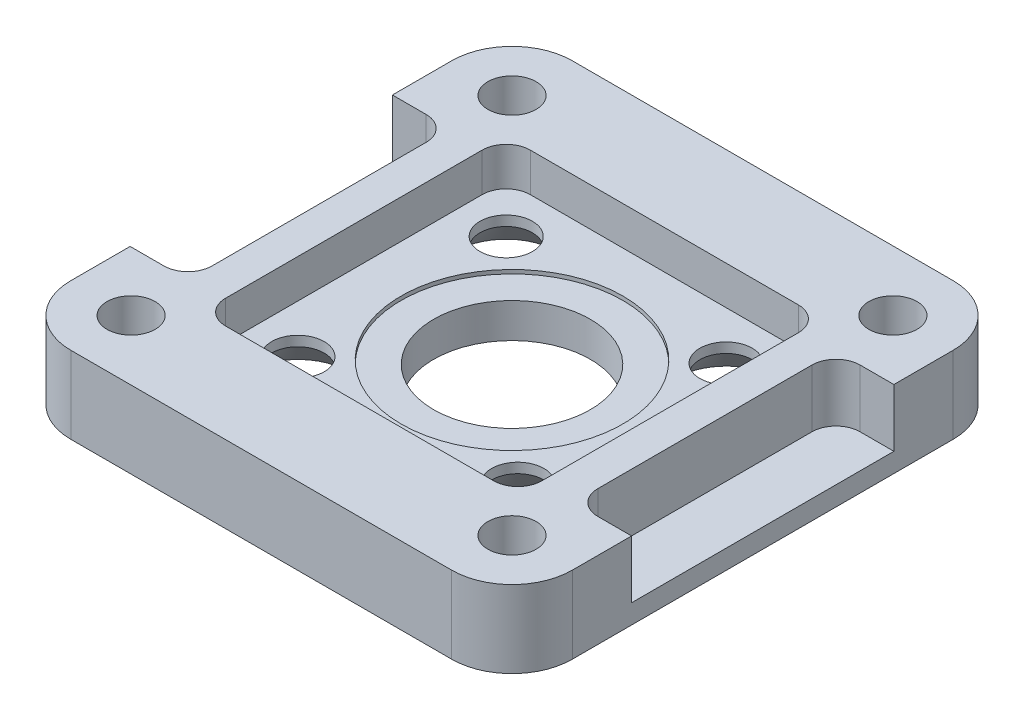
ISO-10303-21;
HEADER;
FILE_DESCRIPTION(('STEP AP214'),'2;1');
FILE_NAME('part.step','',(''),(''),'','','');
FILE_SCHEMA(('AUTOMOTIVE_DESIGN { 1 0 10303 214 1 1 1 1 }'));
ENDSEC;
DATA;
#1=APPLICATION_CONTEXT('core data for automotive mechanical design processes');
#2=APPLICATION_PROTOCOL_DEFINITION('international standard','automotive_design',2000,#1);
#3=PRODUCT_CONTEXT('',#1,'mechanical');
#4=PRODUCT('Part','Part','',(#3));
#5=PRODUCT_RELATED_PRODUCT_CATEGORY('part','',(#4));
#6=PRODUCT_DEFINITION_FORMATION('','',#4);
#7=PRODUCT_DEFINITION_CONTEXT('part definition',#1,'design');
#8=PRODUCT_DEFINITION('design','',#6,#7);
#9=PRODUCT_DEFINITION_SHAPE('','',#8);
#10=(LENGTH_UNIT() NAMED_UNIT(*) SI_UNIT(.MILLI.,.METRE.));
#11=(NAMED_UNIT(*) PLANE_ANGLE_UNIT() SI_UNIT($,.RADIAN.));
#12=(NAMED_UNIT(*) SI_UNIT($,.STERADIAN.) SOLID_ANGLE_UNIT());
#13=UNCERTAINTY_MEASURE_WITH_UNIT(LENGTH_MEASURE(1.E-05),#10,'distance_accuracy_value','');
#14=(GEOMETRIC_REPRESENTATION_CONTEXT(3) GLOBAL_UNCERTAINTY_ASSIGNED_CONTEXT((#13)) GLOBAL_UNIT_ASSIGNED_CONTEXT((#10,
#11,#12)) REPRESENTATION_CONTEXT('',''));
#15=CARTESIAN_POINT('',(0.,0.,0.));
#16=DIRECTION('',(0.,0.,1.));
#17=DIRECTION('',(1.,0.,0.));
#18=AXIS2_PLACEMENT_3D('',#15,#16,#17);
#19=CARTESIAN_POINT('',(0.,0.,0.));
#20=DIRECTION('',(0.,1.,0.));
#21=DIRECTION('',(0.,0.,1.));
#22=AXIS2_PLACEMENT_3D('',#19,#20,#21);
#23=PLANE('',#22);
#24=CARTESIAN_POINT('',(0.,0.,0.));
#25=DIRECTION('',(0.,1.,0.));
#26=DIRECTION('',(0.,0.,1.));
#27=AXIS2_PLACEMENT_3D('',#24,#25,#26);
#28=CIRCLE('',#27,5.15937500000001);
#29=CARTESIAN_POINT('',(0.,0.,5.15937500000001));
#30=VERTEX_POINT('',#29);
#31=EDGE_CURVE('E283',#30,#30,#28,.T.);
#32=ORIENTED_EDGE('',*,*,#31,.T.);
#33=EDGE_LOOP('',(#32));
#34=FACE_BOUND('',#33,.T.);
#35=CARTESIAN_POINT('',(-12.54125,0.,-12.54125));
#36=DIRECTION('',(0.,1.,0.));
#37=DIRECTION('',(0.,0.,1.));
#38=AXIS2_PLACEMENT_3D('',#35,#36,#37);
#39=CIRCLE('',#38,1.5875);
#40=CARTESIAN_POINT('',(-12.54125,0.,-10.95375));
#41=VERTEX_POINT('',#40);
#42=EDGE_CURVE('E308',#41,#41,#39,.T.);
#43=ORIENTED_EDGE('',*,*,#42,.T.);
#44=EDGE_LOOP('',(#43));
#45=FACE_BOUND('',#44,.T.);
#46=CARTESIAN_POINT('',(12.54125,0.,-12.54125));
#47=DIRECTION('',(0.,1.,0.));
#48=DIRECTION('',(0.,0.,1.));
#49=AXIS2_PLACEMENT_3D('',#46,#47,#48);
#50=CIRCLE('',#49,1.5875);
#51=CARTESIAN_POINT('',(12.54125,0.,-10.95375));
#52=VERTEX_POINT('',#51);
#53=EDGE_CURVE('E314',#52,#52,#50,.T.);
#54=ORIENTED_EDGE('',*,*,#53,.T.);
#55=EDGE_LOOP('',(#54));
#56=FACE_BOUND('',#55,.T.);
#57=CARTESIAN_POINT('',(12.54125,0.,12.54125));
#58=DIRECTION('',(0.,1.,0.));
#59=DIRECTION('',(0.,0.,1.));
#60=AXIS2_PLACEMENT_3D('',#57,#58,#59);
#61=CIRCLE('',#60,1.5875);
#62=CARTESIAN_POINT('',(12.54125,0.,14.12875));
#63=VERTEX_POINT('',#62);
#64=EDGE_CURVE('E320',#63,#63,#61,.T.);
#65=ORIENTED_EDGE('',*,*,#64,.T.);
#66=EDGE_LOOP('',(#65));
#67=FACE_BOUND('',#66,.T.);
#68=CARTESIAN_POINT('',(-12.54125,0.,12.54125));
#69=DIRECTION('',(0.,1.,0.));
#70=DIRECTION('',(0.,0.,1.));
#71=AXIS2_PLACEMENT_3D('',#68,#69,#70);
#72=CIRCLE('',#71,1.5875);
#73=CARTESIAN_POINT('',(-12.54125,0.,14.12875));
#74=VERTEX_POINT('',#73);
#75=EDGE_CURVE('E326',#74,#74,#72,.T.);
#76=ORIENTED_EDGE('',*,*,#75,.T.);
#77=EDGE_LOOP('',(#76));
#78=FACE_BOUND('',#77,.T.);
#79=CARTESIAN_POINT('',(-7.239,0.,6.858));
#80=DIRECTION('',(0.,-1.,0.));
#81=DIRECTION('',(0.,0.,-1.));
#82=AXIS2_PLACEMENT_3D('',#79,#80,#81);
#83=CIRCLE('',#82,3.3655);
#84=CARTESIAN_POINT('',(-7.239,0.,3.4925));
#85=VERTEX_POINT('',#84);
#86=EDGE_CURVE('E329',#85,#85,#83,.T.);
#87=ORIENTED_EDGE('',*,*,#86,.F.);
#88=EDGE_LOOP('',(#87));
#89=FACE_BOUND('',#88,.T.);
#90=CARTESIAN_POINT('',(-7.239,0.,-6.858));
#91=DIRECTION('',(0.,-1.,0.));
#92=DIRECTION('',(0.,0.,-1.));
#93=AXIS2_PLACEMENT_3D('',#90,#91,#92);
#94=CIRCLE('',#93,3.3655);
#95=CARTESIAN_POINT('',(-7.239,0.,-10.2235));
#96=VERTEX_POINT('',#95);
#97=EDGE_CURVE('E336',#96,#96,#94,.T.);
#98=ORIENTED_EDGE('',*,*,#97,.F.);
#99=EDGE_LOOP('',(#98));
#100=FACE_BOUND('',#99,.T.);
#101=CARTESIAN_POINT('',(7.239,0.,6.858));
#102=DIRECTION('',(0.,-1.,0.));
#103=DIRECTION('',(0.,0.,-1.));
#104=AXIS2_PLACEMENT_3D('',#101,#102,#103);
#105=CIRCLE('',#104,3.3655);
#106=CARTESIAN_POINT('',(7.239,0.,3.4925));
#107=VERTEX_POINT('',#106);
#108=EDGE_CURVE('E350',#107,#107,#105,.T.);
#109=ORIENTED_EDGE('',*,*,#108,.F.);
#110=EDGE_LOOP('',(#109));
#111=FACE_BOUND('',#110,.T.);
#112=DIRECTION('',(0.,0.,-1.));
#113=VECTOR('',#112,1.);
#114=CARTESIAN_POINT('',(16.51,0.,16.51));
#115=LINE('',#114,#113);
#116=CARTESIAN_POINT('',(16.51,0.,12.54125));
#117=VERTEX_POINT('',#116);
#118=CARTESIAN_POINT('',(16.51,0.,-12.54125));
#119=VERTEX_POINT('',#118);
#120=EDGE_CURVE('E427',#117,#119,#115,.T.);
#121=ORIENTED_EDGE('',*,*,#120,.F.);
#122=CARTESIAN_POINT('',(12.54125,0.,12.54125));
#123=DIRECTION('',(0.,1.,0.));
#124=DIRECTION('',(0.,0.,1.));
#125=AXIS2_PLACEMENT_3D('',#122,#123,#124);
#126=CIRCLE('',#125,3.96875);
#127=CARTESIAN_POINT('',(12.54125,0.,16.51));
#128=VERTEX_POINT('',#127);
#129=EDGE_CURVE('E468',#117,#128,#126,.F.);
#130=ORIENTED_EDGE('',*,*,#129,.T.);
#131=DIRECTION('',(1.,0.,0.));
#132=VECTOR('',#131,1.);
#133=CARTESIAN_POINT('',(-16.51,0.,16.51));
#134=LINE('',#133,#132);
#135=CARTESIAN_POINT('',(-12.54125,0.,16.51));
#136=VERTEX_POINT('',#135);
#137=EDGE_CURVE('E444',#136,#128,#134,.T.);
#138=ORIENTED_EDGE('',*,*,#137,.F.);
#139=CARTESIAN_POINT('',(-12.54125,0.,12.54125));
#140=DIRECTION('',(0.,1.,0.));
#141=DIRECTION('',(0.,0.,1.));
#142=AXIS2_PLACEMENT_3D('',#139,#140,#141);
#143=CIRCLE('',#142,3.96875);
#144=CARTESIAN_POINT('',(-16.51,0.,12.54125));
#145=VERTEX_POINT('',#144);
#146=EDGE_CURVE('E466',#136,#145,#143,.F.);
#147=ORIENTED_EDGE('',*,*,#146,.T.);
#148=DIRECTION('',(0.,0.,1.));
#149=VECTOR('',#148,1.);
#150=CARTESIAN_POINT('',(-16.51,0.,16.51));
#151=LINE('',#150,#149);
#152=CARTESIAN_POINT('',(-16.51,0.,-12.54125));
#153=VERTEX_POINT('',#152);
#154=EDGE_CURVE('E441',#153,#145,#151,.T.);
#155=ORIENTED_EDGE('',*,*,#154,.F.);
#156=CARTESIAN_POINT('',(-12.54125,0.,-12.54125));
#157=DIRECTION('',(0.,1.,0.));
#158=DIRECTION('',(0.,0.,1.));
#159=AXIS2_PLACEMENT_3D('',#156,#157,#158);
#160=CIRCLE('',#159,3.96875);
#161=CARTESIAN_POINT('',(-12.54125,0.,-16.51));
#162=VERTEX_POINT('',#161);
#163=EDGE_CURVE('E462',#153,#162,#160,.F.);
#164=ORIENTED_EDGE('',*,*,#163,.T.);
#165=DIRECTION('',(-1.,0.,0.));
#166=VECTOR('',#165,1.);
#167=CARTESIAN_POINT('',(-16.51,0.,-16.51));
#168=LINE('',#167,#166);
#169=CARTESIAN_POINT('',(12.54125,0.,-16.51));
#170=VERTEX_POINT('',#169);
#171=EDGE_CURVE('E379',#170,#162,#168,.T.);
#172=ORIENTED_EDGE('',*,*,#171,.F.);
#173=CARTESIAN_POINT('',(12.54125,0.,-12.54125));
#174=DIRECTION('',(0.,1.,0.));
#175=DIRECTION('',(0.,0.,1.));
#176=AXIS2_PLACEMENT_3D('',#173,#174,#175);
#177=CIRCLE('',#176,3.96875);
#178=EDGE_CURVE('E464',#170,#119,#177,.F.);
#179=ORIENTED_EDGE('',*,*,#178,.T.);
#180=EDGE_LOOP('',(#121,#130,#138,#147,#155,#164,#172,#179));
#181=FACE_BOUND('',#180,.T.);
#182=CARTESIAN_POINT('',(7.239,0.,-6.858));
#183=DIRECTION('',(0.,-1.,0.));
#184=DIRECTION('',(0.,0.,-1.));
#185=AXIS2_PLACEMENT_3D('',#182,#183,#184);
#186=CIRCLE('',#185,3.3655);
#187=CARTESIAN_POINT('',(7.239,0.,-10.2235));
#188=VERTEX_POINT('',#187);
#189=EDGE_CURVE('E343',#188,#188,#186,.T.);
#190=ORIENTED_EDGE('',*,*,#189,.F.);
#191=EDGE_LOOP('',(#190));
#192=FACE_BOUND('',#191,.T.);
#193=ADVANCED_FACE('F36',(#34,#45,#56,#67,#78,#89,#100,#111,#181,#192),#23,.F.);
#194=CARTESIAN_POINT('',(-16.51,5.08,-16.51));
#195=DIRECTION('',(0.,0.,1.));
#196=DIRECTION('',(1.,0.,0.));
#197=AXIS2_PLACEMENT_3D('',#194,#195,#196);
#198=PLANE('',#197);
#199=DIRECTION('',(-1.,0.,0.));
#200=VECTOR('',#199,1.);
#201=CARTESIAN_POINT('',(-16.51,5.08,-16.51));
#202=LINE('',#201,#200);
#203=CARTESIAN_POINT('',(12.54125,5.08,-16.51));
#204=VERTEX_POINT('',#203);
#205=CARTESIAN_POINT('',(-12.54125,5.08,-16.51));
#206=VERTEX_POINT('',#205);
#207=EDGE_CURVE('E423',#204,#206,#202,.T.);
#208=ORIENTED_EDGE('',*,*,#207,.F.);
#209=DIRECTION('',(0.,-1.,0.));
#210=VECTOR('',#209,1.);
#211=CARTESIAN_POINT('',(12.54125,5.08,-16.51));
#212=LINE('',#211,#210);
#213=EDGE_CURVE('E12',#204,#170,#212,.T.);
#214=ORIENTED_EDGE('',*,*,#213,.T.);
#215=ORIENTED_EDGE('',*,*,#171,.T.);
#216=DIRECTION('',(0.,-1.,0.));
#217=VECTOR('',#216,1.);
#218=CARTESIAN_POINT('',(-12.54125,5.08,-16.51));
#219=LINE('',#218,#217);
#220=EDGE_CURVE('E44',#162,#206,#219,.F.);
#221=ORIENTED_EDGE('',*,*,#220,.T.);
#222=EDGE_LOOP('',(#208,#214,#215,#221));
#223=FACE_BOUND('',#222,.T.);
#224=ADVANCED_FACE('F491',(#223),#198,.F.);
#225=CARTESIAN_POINT('',(-16.51,5.08,16.51));
#226=DIRECTION('',(1.,0.,0.));
#227=DIRECTION('',(0.,0.,-1.));
#228=AXIS2_PLACEMENT_3D('',#225,#226,#227);
#229=PLANE('',#228);
#230=DIRECTION('',(0.,0.,-1.));
#231=VECTOR('',#230,1.);
#232=CARTESIAN_POINT('',(-16.51,1.27,-8.636));
#233=LINE('',#232,#231);
#234=CARTESIAN_POINT('',(-16.51,1.27,8.636));
#235=VERTEX_POINT('',#234);
#236=CARTESIAN_POINT('',(-16.51,1.27,-8.636));
#237=VERTEX_POINT('',#236);
#238=EDGE_CURVE('E267',#235,#237,#233,.T.);
#239=ORIENTED_EDGE('',*,*,#238,.T.);
#240=DIRECTION('',(0.,1.,0.));
#241=VECTOR('',#240,1.);
#242=CARTESIAN_POINT('',(-16.51,-17.6872294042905,-8.636));
#243=LINE('',#242,#241);
#244=CARTESIAN_POINT('',(-16.51,5.08,-8.636));
#245=VERTEX_POINT('',#244);
#246=EDGE_CURVE('E255',#237,#245,#243,.T.);
#247=ORIENTED_EDGE('',*,*,#246,.T.);
#248=DIRECTION('',(0.,0.,1.));
#249=VECTOR('',#248,1.);
#250=CARTESIAN_POINT('',(-16.51,5.08,16.51));
#251=LINE('',#250,#249);
#252=CARTESIAN_POINT('',(-16.51,5.08,-12.54125));
#253=VERTEX_POINT('',#252);
#254=EDGE_CURVE('E428',#253,#245,#251,.T.);
#255=ORIENTED_EDGE('',*,*,#254,.F.);
#256=DIRECTION('',(0.,-1.,0.));
#257=VECTOR('',#256,1.);
#258=CARTESIAN_POINT('',(-16.51,5.08,-12.54125));
#259=LINE('',#258,#257);
#260=EDGE_CURVE('E483',#253,#153,#259,.T.);
#261=ORIENTED_EDGE('',*,*,#260,.T.);
#262=ORIENTED_EDGE('',*,*,#154,.T.);
#263=DIRECTION('',(0.,-1.,0.));
#264=VECTOR('',#263,1.);
#265=CARTESIAN_POINT('',(-16.51,5.08,12.54125));
#266=LINE('',#265,#264);
#267=CARTESIAN_POINT('',(-16.51,5.08,12.54125));
#268=VERTEX_POINT('',#267);
#269=EDGE_CURVE('E486',#145,#268,#266,.F.);
#270=ORIENTED_EDGE('',*,*,#269,.T.);
#271=CARTESIAN_POINT('',(-16.51,5.08,8.636));
#272=VERTEX_POINT('',#271);
#273=EDGE_CURVE('E426',#272,#268,#251,.T.);
#274=ORIENTED_EDGE('',*,*,#273,.F.);
#275=DIRECTION('',(0.,1.,0.));
#276=VECTOR('',#275,1.);
#277=CARTESIAN_POINT('',(-16.51,-17.6872294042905,8.636));
#278=LINE('',#277,#276);
#279=EDGE_CURVE('E51',#235,#272,#278,.T.);
#280=ORIENTED_EDGE('',*,*,#279,.F.);
#281=EDGE_LOOP('',(#239,#247,#255,#261,#262,#270,#274,#280));
#282=FACE_BOUND('',#281,.T.);
#283=ADVANCED_FACE('F502',(#282),#229,.F.);
#284=CARTESIAN_POINT('',(-16.51,5.08,16.51));
#285=DIRECTION('',(0.,0.,-1.));
#286=DIRECTION('',(-1.,0.,0.));
#287=AXIS2_PLACEMENT_3D('',#284,#285,#286);
#288=PLANE('',#287);
#289=ORIENTED_EDGE('',*,*,#137,.T.);
#290=DIRECTION('',(0.,-1.,0.));
#291=VECTOR('',#290,1.);
#292=CARTESIAN_POINT('',(12.54125,5.08,16.51));
#293=LINE('',#292,#291);
#294=CARTESIAN_POINT('',(12.54125,5.08,16.51));
#295=VERTEX_POINT('',#294);
#296=EDGE_CURVE('E473',#128,#295,#293,.F.);
#297=ORIENTED_EDGE('',*,*,#296,.T.);
#298=DIRECTION('',(1.,0.,0.));
#299=VECTOR('',#298,1.);
#300=CARTESIAN_POINT('',(-16.51,5.08,16.51));
#301=LINE('',#300,#299);
#302=CARTESIAN_POINT('',(-12.54125,5.08,16.51));
#303=VERTEX_POINT('',#302);
#304=EDGE_CURVE('E431',#303,#295,#301,.T.);
#305=ORIENTED_EDGE('',*,*,#304,.F.);
#306=DIRECTION('',(0.,-1.,0.));
#307=VECTOR('',#306,1.);
#308=CARTESIAN_POINT('',(-12.54125,5.08,16.51));
#309=LINE('',#308,#307);
#310=EDGE_CURVE('E470',#303,#136,#309,.T.);
#311=ORIENTED_EDGE('',*,*,#310,.T.);
#312=EDGE_LOOP('',(#289,#297,#305,#311));
#313=FACE_BOUND('',#312,.T.);
#314=ADVANCED_FACE('F514',(#313),#288,.F.);
#315=CARTESIAN_POINT('',(16.51,5.08,16.51));
#316=DIRECTION('',(-1.,0.,0.));
#317=DIRECTION('',(0.,0.,1.));
#318=AXIS2_PLACEMENT_3D('',#315,#316,#317);
#319=PLANE('',#318);
#320=DIRECTION('',(0.,0.,1.));
#321=VECTOR('',#320,1.);
#322=CARTESIAN_POINT('',(16.51,1.27,-8.636));
#323=LINE('',#322,#321);
#324=CARTESIAN_POINT('',(16.51,1.27,-8.636));
#325=VERTEX_POINT('',#324);
#326=CARTESIAN_POINT('',(16.51,1.27,8.636));
#327=VERTEX_POINT('',#326);
#328=EDGE_CURVE('E277',#325,#327,#323,.T.);
#329=ORIENTED_EDGE('',*,*,#328,.T.);
#330=DIRECTION('',(0.,1.,0.));
#331=VECTOR('',#330,1.);
#332=CARTESIAN_POINT('',(16.51,-17.6872294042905,8.636));
#333=LINE('',#332,#331);
#334=CARTESIAN_POINT('',(16.51,5.08,8.636));
#335=VERTEX_POINT('',#334);
#336=EDGE_CURVE('E271',#327,#335,#333,.T.);
#337=ORIENTED_EDGE('',*,*,#336,.T.);
#338=DIRECTION('',(0.,0.,-1.));
#339=VECTOR('',#338,1.);
#340=CARTESIAN_POINT('',(16.51,5.08,16.51));
#341=LINE('',#340,#339);
#342=CARTESIAN_POINT('',(16.51,5.08,12.54125));
#343=VERTEX_POINT('',#342);
#344=EDGE_CURVE('E435',#343,#335,#341,.T.);
#345=ORIENTED_EDGE('',*,*,#344,.F.);
#346=DIRECTION('',(0.,-1.,0.));
#347=VECTOR('',#346,1.);
#348=CARTESIAN_POINT('',(16.51,5.08,12.54125));
#349=LINE('',#348,#347);
#350=EDGE_CURVE('E459',#343,#117,#349,.T.);
#351=ORIENTED_EDGE('',*,*,#350,.T.);
#352=ORIENTED_EDGE('',*,*,#120,.T.);
#353=DIRECTION('',(0.,-1.,0.));
#354=VECTOR('',#353,1.);
#355=CARTESIAN_POINT('',(16.51,5.08,-12.54125));
#356=LINE('',#355,#354);
#357=CARTESIAN_POINT('',(16.51,5.08,-12.54125));
#358=VERTEX_POINT('',#357);
#359=EDGE_CURVE('E438',#119,#358,#356,.F.);
#360=ORIENTED_EDGE('',*,*,#359,.T.);
#361=CARTESIAN_POINT('',(16.51,5.08,-8.636));
#362=VERTEX_POINT('',#361);
#363=EDGE_CURVE('E434',#362,#358,#341,.T.);
#364=ORIENTED_EDGE('',*,*,#363,.F.);
#365=DIRECTION('',(0.,1.,0.));
#366=VECTOR('',#365,1.);
#367=CARTESIAN_POINT('',(16.51,-17.6872294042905,-8.636));
#368=LINE('',#367,#366);
#369=EDGE_CURVE('E59',#325,#362,#368,.T.);
#370=ORIENTED_EDGE('',*,*,#369,.F.);
#371=EDGE_LOOP('',(#329,#337,#345,#351,#352,#360,#364,#370));
#372=FACE_BOUND('',#371,.T.);
#373=ADVANCED_FACE('F522',(#372),#319,.F.);
#374=CARTESIAN_POINT('',(0.,5.08,0.));
#375=DIRECTION('',(0.,1.,0.));
#376=DIRECTION('',(0.,0.,1.));
#377=AXIS2_PLACEMENT_3D('',#374,#375,#376);
#378=PLANE('',#377);
#379=DIRECTION('',(-1.,0.,0.));
#380=VECTOR('',#379,1.);
#381=CARTESIAN_POINT('',(-16.51,5.08,-8.636));
#382=LINE('',#381,#380);
#383=CARTESIAN_POINT('',(-14.2875,5.08,-8.636));
#384=VERTEX_POINT('',#383);
#385=EDGE_CURVE('E253',#384,#245,#382,.T.);
#386=ORIENTED_EDGE('',*,*,#385,.F.);
#387=CARTESIAN_POINT('',(-14.2875,5.08,-7.0485));
#388=DIRECTION('',(0.,1.,0.));
#389=DIRECTION('',(0.,0.,-1.));
#390=AXIS2_PLACEMENT_3D('',#387,#388,#389);
#391=CIRCLE('',#390,1.5875);
#392=CARTESIAN_POINT('',(-12.7,5.08,-7.0485));
#393=VERTEX_POINT('',#392);
#394=EDGE_CURVE('E247',#393,#384,#391,.T.);
#395=ORIENTED_EDGE('',*,*,#394,.F.);
#396=DIRECTION('',(0.,0.,-1.));
#397=VECTOR('',#396,1.);
#398=CARTESIAN_POINT('',(-12.7,5.08,-7.0485));
#399=LINE('',#398,#397);
#400=CARTESIAN_POINT('',(-12.7,5.08,7.0485));
#401=VERTEX_POINT('',#400);
#402=EDGE_CURVE('E245',#401,#393,#399,.T.);
#403=ORIENTED_EDGE('',*,*,#402,.F.);
#404=CARTESIAN_POINT('',(-14.2875,5.08,7.0485));
#405=DIRECTION('',(0.,1.,0.));
#406=DIRECTION('',(0.,0.,1.));
#407=AXIS2_PLACEMENT_3D('',#404,#405,#406);
#408=CIRCLE('',#407,1.5875);
#409=CARTESIAN_POINT('',(-14.2875,5.08,8.636));
#410=VERTEX_POINT('',#409);
#411=EDGE_CURVE('E227',#410,#401,#408,.T.);
#412=ORIENTED_EDGE('',*,*,#411,.F.);
#413=DIRECTION('',(1.,0.,0.));
#414=VECTOR('',#413,1.);
#415=CARTESIAN_POINT('',(-16.51,5.08,8.636));
#416=LINE('',#415,#414);
#417=EDGE_CURVE('E234',#272,#410,#416,.T.);
#418=ORIENTED_EDGE('',*,*,#417,.F.);
#419=ORIENTED_EDGE('',*,*,#273,.T.);
#420=CARTESIAN_POINT('',(-12.54125,5.08,12.54125));
#421=DIRECTION('',(0.,1.,0.));
#422=DIRECTION('',(0.,0.,1.));
#423=AXIS2_PLACEMENT_3D('',#420,#421,#422);
#424=CIRCLE('',#423,3.96875);
#425=EDGE_CURVE('E479',#268,#303,#424,.T.);
#426=ORIENTED_EDGE('',*,*,#425,.T.);
#427=ORIENTED_EDGE('',*,*,#304,.T.);
#428=CARTESIAN_POINT('',(12.54125,5.08,12.54125));
#429=DIRECTION('',(0.,1.,0.));
#430=DIRECTION('',(0.,0.,1.));
#431=AXIS2_PLACEMENT_3D('',#428,#429,#430);
#432=CIRCLE('',#431,3.96875);
#433=EDGE_CURVE('E481',#295,#343,#432,.T.);
#434=ORIENTED_EDGE('',*,*,#433,.T.);
#435=ORIENTED_EDGE('',*,*,#344,.T.);
#436=DIRECTION('',(1.,0.,0.));
#437=VECTOR('',#436,1.);
#438=CARTESIAN_POINT('',(16.51,5.08,8.636));
#439=LINE('',#438,#437);
#440=CARTESIAN_POINT('',(14.2875,5.08,8.63599999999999));
#441=VERTEX_POINT('',#440);
#442=EDGE_CURVE('E292',#441,#335,#439,.T.);
#443=ORIENTED_EDGE('',*,*,#442,.F.);
#444=CARTESIAN_POINT('',(14.2875,5.08,7.04849999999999));
#445=DIRECTION('',(0.,1.,0.));
#446=DIRECTION('',(0.,0.,-1.));
#447=AXIS2_PLACEMENT_3D('',#444,#445,#446);
#448=CIRCLE('',#447,1.5875);
#449=CARTESIAN_POINT('',(12.7,5.08,7.04849999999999));
#450=VERTEX_POINT('',#449);
#451=EDGE_CURVE('E289',#450,#441,#448,.T.);
#452=ORIENTED_EDGE('',*,*,#451,.F.);
#453=DIRECTION('',(0.,0.,1.));
#454=VECTOR('',#453,1.);
#455=CARTESIAN_POINT('',(12.7,5.08,-7.0485));
#456=LINE('',#455,#454);
#457=CARTESIAN_POINT('',(12.7,5.08,-7.0485));
#458=VERTEX_POINT('',#457);
#459=EDGE_CURVE('E286',#458,#450,#456,.T.);
#460=ORIENTED_EDGE('',*,*,#459,.F.);
#461=CARTESIAN_POINT('',(14.2875,5.08,-7.0485));
#462=DIRECTION('',(0.,1.,0.));
#463=DIRECTION('',(0.,0.,1.));
#464=AXIS2_PLACEMENT_3D('',#461,#462,#463);
#465=CIRCLE('',#464,1.5875);
#466=CARTESIAN_POINT('',(14.2875,5.08,-8.636));
#467=VERTEX_POINT('',#466);
#468=EDGE_CURVE('E282',#467,#458,#465,.T.);
#469=ORIENTED_EDGE('',*,*,#468,.F.);
#470=DIRECTION('',(-1.,0.,0.));
#471=VECTOR('',#470,1.);
#472=CARTESIAN_POINT('',(16.51,5.08,-8.636));
#473=LINE('',#472,#471);
#474=EDGE_CURVE('E280',#362,#467,#473,.T.);
#475=ORIENTED_EDGE('',*,*,#474,.F.);
#476=ORIENTED_EDGE('',*,*,#363,.T.);
#477=CARTESIAN_POINT('',(12.54125,5.08,-12.54125));
#478=DIRECTION('',(0.,1.,0.));
#479=DIRECTION('',(0.,0.,1.));
#480=AXIS2_PLACEMENT_3D('',#477,#478,#479);
#481=CIRCLE('',#480,3.96875);
#482=EDGE_CURVE('E477',#358,#204,#481,.T.);
#483=ORIENTED_EDGE('',*,*,#482,.T.);
#484=ORIENTED_EDGE('',*,*,#207,.T.);
#485=CARTESIAN_POINT('',(-12.54125,5.08,-12.54125));
#486=DIRECTION('',(0.,1.,0.));
#487=DIRECTION('',(0.,0.,1.));
#488=AXIS2_PLACEMENT_3D('',#485,#486,#487);
#489=CIRCLE('',#488,3.96875);
#490=EDGE_CURVE('E475',#206,#253,#489,.T.);
#491=ORIENTED_EDGE('',*,*,#490,.T.);
#492=ORIENTED_EDGE('',*,*,#254,.T.);
#493=EDGE_LOOP('',(#386,#395,#403,#412,#418,#419,#426,#427,#434,#435,#443,#452,#460,#469,#475,
#476,#483,#484,#491,#492));
#494=FACE_BOUND('',#493,.T.);
#495=CARTESIAN_POINT('',(-12.54125,5.08,-12.54125));
#496=DIRECTION('',(0.,1.,0.));
#497=DIRECTION('',(0.,0.,1.));
#498=AXIS2_PLACEMENT_3D('',#495,#496,#497);
#499=CIRCLE('',#498,1.58749999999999);
#500=CARTESIAN_POINT('',(-12.54125,5.08,-10.95375));
#501=VERTEX_POINT('',#500);
#502=EDGE_CURVE('E266',#501,#501,#499,.T.);
#503=ORIENTED_EDGE('',*,*,#502,.F.);
#504=EDGE_LOOP('',(#503));
#505=FACE_BOUND('',#504,.T.);
#506=CARTESIAN_POINT('',(12.54125,5.08,-12.54125));
#507=DIRECTION('',(0.,1.,0.));
#508=DIRECTION('',(0.,0.,1.));
#509=AXIS2_PLACEMENT_3D('',#506,#507,#508);
#510=CIRCLE('',#509,1.58749999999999);
#511=CARTESIAN_POINT('',(12.54125,5.08,-10.95375));
#512=VERTEX_POINT('',#511);
#513=EDGE_CURVE('E311',#512,#512,#510,.T.);
#514=ORIENTED_EDGE('',*,*,#513,.F.);
#515=EDGE_LOOP('',(#514));
#516=FACE_BOUND('',#515,.T.);
#517=CARTESIAN_POINT('',(12.54125,5.08,12.54125));
#518=DIRECTION('',(0.,1.,0.));
#519=DIRECTION('',(0.,0.,1.));
#520=AXIS2_PLACEMENT_3D('',#517,#518,#519);
#521=CIRCLE('',#520,1.58749999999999);
#522=CARTESIAN_POINT('',(12.54125,5.08,14.12875));
#523=VERTEX_POINT('',#522);
#524=EDGE_CURVE('E317',#523,#523,#521,.T.);
#525=ORIENTED_EDGE('',*,*,#524,.F.);
#526=EDGE_LOOP('',(#525));
#527=FACE_BOUND('',#526,.T.);
#528=CARTESIAN_POINT('',(-12.54125,5.08,12.54125));
#529=DIRECTION('',(0.,1.,0.));
#530=DIRECTION('',(0.,0.,1.));
#531=AXIS2_PLACEMENT_3D('',#528,#529,#530);
#532=CIRCLE('',#531,1.58749999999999);
#533=CARTESIAN_POINT('',(-12.54125,5.08,14.12875));
#534=VERTEX_POINT('',#533);
#535=EDGE_CURVE('E323',#534,#534,#532,.T.);
#536=ORIENTED_EDGE('',*,*,#535,.F.);
#537=EDGE_LOOP('',(#536));
#538=FACE_BOUND('',#537,.T.);
#539=CARTESIAN_POINT('',(8.82650000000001,5.08,-8.4455));
#540=DIRECTION('',(0.,-1.,0.));
#541=DIRECTION('',(0.,0.,-1.));
#542=AXIS2_PLACEMENT_3D('',#539,#540,#541);
#543=CIRCLE('',#542,1.5875);
#544=CARTESIAN_POINT('',(8.82650000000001,5.08,-10.033));
#545=VERTEX_POINT('',#544);
#546=CARTESIAN_POINT('',(10.414,5.08,-8.4455));
#547=VERTEX_POINT('',#546);
#548=EDGE_CURVE('E398',#545,#547,#543,.T.);
#549=ORIENTED_EDGE('',*,*,#548,.T.);
#550=DIRECTION('',(0.,0.,1.));
#551=VECTOR('',#550,1.);
#552=CARTESIAN_POINT('',(10.414,5.08,-8.4455));
#553=LINE('',#552,#551);
#554=CARTESIAN_POINT('',(10.414,5.08,8.4455));
#555=VERTEX_POINT('',#554);
#556=EDGE_CURVE('E401',#547,#555,#553,.T.);
#557=ORIENTED_EDGE('',*,*,#556,.T.);
#558=CARTESIAN_POINT('',(8.82650000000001,5.08,8.4455));
#559=DIRECTION('',(0.,-1.,0.));
#560=DIRECTION('',(0.,0.,-1.));
#561=AXIS2_PLACEMENT_3D('',#558,#559,#560);
#562=CIRCLE('',#561,1.5875);
#563=CARTESIAN_POINT('',(8.82650000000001,5.08,10.033));
#564=VERTEX_POINT('',#563);
#565=EDGE_CURVE('E380',#555,#564,#562,.T.);
#566=ORIENTED_EDGE('',*,*,#565,.T.);
#567=DIRECTION('',(-1.,0.,0.));
#568=VECTOR('',#567,1.);
#569=CARTESIAN_POINT('',(8.82650000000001,5.08,10.033));
#570=LINE('',#569,#568);
#571=CARTESIAN_POINT('',(-8.8265,5.08,10.033));
#572=VERTEX_POINT('',#571);
#573=EDGE_CURVE('E383',#564,#572,#570,.T.);
#574=ORIENTED_EDGE('',*,*,#573,.T.);
#575=CARTESIAN_POINT('',(-8.8265,5.08,8.4455));
#576=DIRECTION('',(0.,-1.,0.));
#577=DIRECTION('',(0.,0.,-1.));
#578=AXIS2_PLACEMENT_3D('',#575,#576,#577);
#579=CIRCLE('',#578,1.5875);
#580=CARTESIAN_POINT('',(-10.414,5.08,8.4455));
#581=VERTEX_POINT('',#580);
#582=EDGE_CURVE('E386',#572,#581,#579,.T.);
#583=ORIENTED_EDGE('',*,*,#582,.T.);
#584=DIRECTION('',(0.,0.,-1.));
#585=VECTOR('',#584,1.);
#586=CARTESIAN_POINT('',(-10.414,5.08,-8.4455));
#587=LINE('',#586,#585);
#588=CARTESIAN_POINT('',(-10.414,5.08,-8.4455));
#589=VERTEX_POINT('',#588);
#590=EDGE_CURVE('E389',#581,#589,#587,.T.);
#591=ORIENTED_EDGE('',*,*,#590,.T.);
#592=CARTESIAN_POINT('',(-8.8265,5.08,-8.4455));
#593=DIRECTION('',(0.,-1.,0.));
#594=DIRECTION('',(0.,0.,1.));
#595=AXIS2_PLACEMENT_3D('',#592,#593,#594);
#596=CIRCLE('',#595,1.5875);
#597=CARTESIAN_POINT('',(-8.8265,5.08,-10.033));
#598=VERTEX_POINT('',#597);
#599=EDGE_CURVE('E392',#589,#598,#596,.T.);
#600=ORIENTED_EDGE('',*,*,#599,.T.);
#601=DIRECTION('',(1.,0.,0.));
#602=VECTOR('',#601,1.);
#603=CARTESIAN_POINT('',(8.82650000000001,5.08,-10.033));
#604=LINE('',#603,#602);
#605=EDGE_CURVE('E395',#598,#545,#604,.T.);
#606=ORIENTED_EDGE('',*,*,#605,.T.);
#607=EDGE_LOOP('',(#549,#557,#566,#574,#583,#591,#600,#606));
#608=FACE_BOUND('',#607,.T.);
#609=ADVANCED_FACE('F241',(#494,#505,#516,#527,#538,#608),#378,.T.);
#610=CARTESIAN_POINT('',(10.414,-28.9214442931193,-8.4455));
#611=DIRECTION('',(-1.,0.,0.));
#612=DIRECTION('',(0.,0.,1.));
#613=AXIS2_PLACEMENT_3D('',#610,#611,#612);
#614=PLANE('',#613);
#615=DIRECTION('',(0.,1.,0.));
#616=VECTOR('',#615,1.);
#617=CARTESIAN_POINT('',(10.414,-28.9214442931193,8.4455));
#618=LINE('',#617,#616);
#619=CARTESIAN_POINT('',(10.414,2.54,8.4455));
#620=VERTEX_POINT('',#619);
#621=EDGE_CURVE('E404',#620,#555,#618,.T.);
#622=ORIENTED_EDGE('',*,*,#621,.T.);
#623=ORIENTED_EDGE('',*,*,#556,.F.);
#624=DIRECTION('',(0.,1.,0.));
#625=VECTOR('',#624,1.);
#626=CARTESIAN_POINT('',(10.414,-28.9214442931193,-8.4455));
#627=LINE('',#626,#625);
#628=CARTESIAN_POINT('',(10.414,2.54,-8.4455));
#629=VERTEX_POINT('',#628);
#630=EDGE_CURVE('E406',#629,#547,#627,.T.);
#631=ORIENTED_EDGE('',*,*,#630,.F.);
#632=DIRECTION('',(0.,0.,-1.));
#633=VECTOR('',#632,1.);
#634=CARTESIAN_POINT('',(10.414,2.54,-8.4455));
#635=LINE('',#634,#633);
#636=EDGE_CURVE('E361',#620,#629,#635,.T.);
#637=ORIENTED_EDGE('',*,*,#636,.F.);
#638=EDGE_LOOP('',(#622,#623,#631,#637));
#639=FACE_BOUND('',#638,.T.);
#640=ADVANCED_FACE('F690',(#639),#614,.T.);
#641=CARTESIAN_POINT('',(8.82650000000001,-28.9214442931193,-8.4455));
#642=DIRECTION('',(0.,1.,0.));
#643=DIRECTION('',(0.,0.,1.));
#644=AXIS2_PLACEMENT_3D('',#641,#642,#643);
#645=CYLINDRICAL_SURFACE('',#644,1.5875);
#646=ORIENTED_EDGE('',*,*,#630,.T.);
#647=ORIENTED_EDGE('',*,*,#548,.F.);
#648=DIRECTION('',(0.,1.,0.));
#649=VECTOR('',#648,1.);
#650=CARTESIAN_POINT('',(8.82650000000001,-28.9214442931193,-10.033));
#651=LINE('',#650,#649);
#652=CARTESIAN_POINT('',(8.82650000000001,2.54,-10.033));
#653=VERTEX_POINT('',#652);
#654=EDGE_CURVE('E408',#653,#545,#651,.T.);
#655=ORIENTED_EDGE('',*,*,#654,.F.);
#656=CARTESIAN_POINT('',(8.82650000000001,2.54,-8.4455));
#657=DIRECTION('',(0.,1.,0.));
#658=DIRECTION('',(0.,0.,1.));
#659=AXIS2_PLACEMENT_3D('',#656,#657,#658);
#660=CIRCLE('',#659,1.5875);
#661=EDGE_CURVE('E357',#629,#653,#660,.T.);
#662=ORIENTED_EDGE('',*,*,#661,.F.);
#663=EDGE_LOOP('',(#646,#647,#655,#662));
#664=FACE_BOUND('',#663,.T.);
#665=ADVANCED_FACE('F694',(#664),#645,.F.);
#666=CARTESIAN_POINT('',(8.82650000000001,-28.9214442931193,-10.033));
#667=DIRECTION('',(0.,0.,1.));
#668=DIRECTION('',(1.,0.,0.));
#669=AXIS2_PLACEMENT_3D('',#666,#667,#668);
#670=PLANE('',#669);
#671=ORIENTED_EDGE('',*,*,#654,.T.);
#672=ORIENTED_EDGE('',*,*,#605,.F.);
#673=DIRECTION('',(0.,1.,0.));
#674=VECTOR('',#673,1.);
#675=CARTESIAN_POINT('',(-8.8265,-28.9214442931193,-10.033));
#676=LINE('',#675,#674);
#677=CARTESIAN_POINT('',(-8.8265,2.54,-10.033));
#678=VERTEX_POINT('',#677);
#679=EDGE_CURVE('E410',#678,#598,#676,.T.);
#680=ORIENTED_EDGE('',*,*,#679,.F.);
#681=DIRECTION('',(-1.,0.,0.));
#682=VECTOR('',#681,1.);
#683=CARTESIAN_POINT('',(8.82650000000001,2.54,-10.033));
#684=LINE('',#683,#682);
#685=EDGE_CURVE('E360',#653,#678,#684,.T.);
#686=ORIENTED_EDGE('',*,*,#685,.F.);
#687=EDGE_LOOP('',(#671,#672,#680,#686));
#688=FACE_BOUND('',#687,.T.);
#689=ADVANCED_FACE('F698',(#688),#670,.T.);
#690=CARTESIAN_POINT('',(-8.8265,-28.9214442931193,-8.4455));
#691=DIRECTION('',(0.,1.,0.));
#692=DIRECTION('',(0.,0.,1.));
#693=AXIS2_PLACEMENT_3D('',#690,#691,#692);
#694=CYLINDRICAL_SURFACE('',#693,1.5875);
#695=ORIENTED_EDGE('',*,*,#679,.T.);
#696=ORIENTED_EDGE('',*,*,#599,.F.);
#697=DIRECTION('',(0.,1.,0.));
#698=VECTOR('',#697,1.);
#699=CARTESIAN_POINT('',(-10.414,-28.9214442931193,-8.4455));
#700=LINE('',#699,#698);
#701=CARTESIAN_POINT('',(-10.414,2.54,-8.4455));
#702=VERTEX_POINT('',#701);
#703=EDGE_CURVE('E412',#702,#589,#700,.T.);
#704=ORIENTED_EDGE('',*,*,#703,.F.);
#705=CARTESIAN_POINT('',(-8.8265,2.54,-8.4455));
#706=DIRECTION('',(0.,1.,0.));
#707=DIRECTION('',(0.,0.,1.));
#708=AXIS2_PLACEMENT_3D('',#705,#706,#707);
#709=CIRCLE('',#708,1.5875);
#710=EDGE_CURVE('E364',#678,#702,#709,.T.);
#711=ORIENTED_EDGE('',*,*,#710,.F.);
#712=EDGE_LOOP('',(#695,#696,#704,#711));
#713=FACE_BOUND('',#712,.T.);
#714=ADVANCED_FACE('F702',(#713),#694,.F.);
#715=CARTESIAN_POINT('',(-10.414,-28.9214442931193,-8.4455));
#716=DIRECTION('',(1.,0.,0.));
#717=DIRECTION('',(0.,0.,-1.));
#718=AXIS2_PLACEMENT_3D('',#715,#716,#717);
#719=PLANE('',#718);
#720=ORIENTED_EDGE('',*,*,#703,.T.);
#721=ORIENTED_EDGE('',*,*,#590,.F.);
#722=DIRECTION('',(0.,1.,0.));
#723=VECTOR('',#722,1.);
#724=CARTESIAN_POINT('',(-10.414,-28.9214442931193,8.4455));
#725=LINE('',#724,#723);
#726=CARTESIAN_POINT('',(-10.414,2.54,8.4455));
#727=VERTEX_POINT('',#726);
#728=EDGE_CURVE('E414',#727,#581,#725,.T.);
#729=ORIENTED_EDGE('',*,*,#728,.F.);
#730=DIRECTION('',(0.,0.,1.));
#731=VECTOR('',#730,1.);
#732=CARTESIAN_POINT('',(-10.414,2.54,-8.4455));
#733=LINE('',#732,#731);
#734=EDGE_CURVE('E367',#702,#727,#733,.T.);
#735=ORIENTED_EDGE('',*,*,#734,.F.);
#736=EDGE_LOOP('',(#720,#721,#729,#735));
#737=FACE_BOUND('',#736,.T.);
#738=ADVANCED_FACE('F705',(#737),#719,.T.);
#739=CARTESIAN_POINT('',(-8.8265,-28.9214442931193,8.4455));
#740=DIRECTION('',(0.,1.,0.));
#741=DIRECTION('',(0.,0.,1.));
#742=AXIS2_PLACEMENT_3D('',#739,#740,#741);
#743=CYLINDRICAL_SURFACE('',#742,1.5875);
#744=ORIENTED_EDGE('',*,*,#728,.T.);
#745=ORIENTED_EDGE('',*,*,#582,.F.);
#746=DIRECTION('',(0.,1.,0.));
#747=VECTOR('',#746,1.);
#748=CARTESIAN_POINT('',(-8.8265,-28.9214442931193,10.033));
#749=LINE('',#748,#747);
#750=CARTESIAN_POINT('',(-8.8265,2.54,10.033));
#751=VERTEX_POINT('',#750);
#752=EDGE_CURVE('E416',#751,#572,#749,.T.);
#753=ORIENTED_EDGE('',*,*,#752,.F.);
#754=CARTESIAN_POINT('',(-8.8265,2.54,8.4455));
#755=DIRECTION('',(0.,1.,0.));
#756=DIRECTION('',(0.,0.,1.));
#757=AXIS2_PLACEMENT_3D('',#754,#755,#756);
#758=CIRCLE('',#757,1.5875);
#759=EDGE_CURVE('E370',#727,#751,#758,.T.);
#760=ORIENTED_EDGE('',*,*,#759,.F.);
#761=EDGE_LOOP('',(#744,#745,#753,#760));
#762=FACE_BOUND('',#761,.T.);
#763=ADVANCED_FACE('F682',(#762),#743,.F.);
#764=CARTESIAN_POINT('',(8.82650000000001,-28.9214442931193,10.033));
#765=DIRECTION('',(0.,0.,-1.));
#766=DIRECTION('',(-1.,0.,0.));
#767=AXIS2_PLACEMENT_3D('',#764,#765,#766);
#768=PLANE('',#767);
#769=ORIENTED_EDGE('',*,*,#752,.T.);
#770=ORIENTED_EDGE('',*,*,#573,.F.);
#771=DIRECTION('',(0.,1.,0.));
#772=VECTOR('',#771,1.);
#773=CARTESIAN_POINT('',(8.82650000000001,-28.9214442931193,10.033));
#774=LINE('',#773,#772);
#775=CARTESIAN_POINT('',(8.82650000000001,2.54,10.033));
#776=VERTEX_POINT('',#775);
#777=EDGE_CURVE('E418',#776,#564,#774,.T.);
#778=ORIENTED_EDGE('',*,*,#777,.F.);
#779=DIRECTION('',(1.,0.,0.));
#780=VECTOR('',#779,1.);
#781=CARTESIAN_POINT('',(8.82650000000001,2.54,10.033));
#782=LINE('',#781,#780);
#783=EDGE_CURVE('E373',#751,#776,#782,.T.);
#784=ORIENTED_EDGE('',*,*,#783,.F.);
#785=EDGE_LOOP('',(#769,#770,#778,#784));
#786=FACE_BOUND('',#785,.T.);
#787=ADVANCED_FACE('F679',(#786),#768,.T.);
#788=CARTESIAN_POINT('',(8.82650000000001,-28.9214442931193,8.4455));
#789=DIRECTION('',(0.,1.,0.));
#790=DIRECTION('',(0.,0.,1.));
#791=AXIS2_PLACEMENT_3D('',#788,#789,#790);
#792=CYLINDRICAL_SURFACE('',#791,1.5875);
#793=ORIENTED_EDGE('',*,*,#777,.T.);
#794=ORIENTED_EDGE('',*,*,#565,.F.);
#795=ORIENTED_EDGE('',*,*,#621,.F.);
#796=CARTESIAN_POINT('',(8.82650000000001,2.54,8.4455));
#797=DIRECTION('',(0.,1.,0.));
#798=DIRECTION('',(0.,0.,1.));
#799=AXIS2_PLACEMENT_3D('',#796,#797,#798);
#800=CIRCLE('',#799,1.5875);
#801=EDGE_CURVE('E376',#776,#620,#800,.T.);
#802=ORIENTED_EDGE('',*,*,#801,.F.);
#803=EDGE_LOOP('',(#793,#794,#795,#802));
#804=FACE_BOUND('',#803,.T.);
#805=ADVANCED_FACE('F665',(#804),#792,.F.);
#806=CARTESIAN_POINT('',(0.,2.54,0.));
#807=DIRECTION('',(0.,1.,0.));
#808=DIRECTION('',(0.,0.,1.));
#809=AXIS2_PLACEMENT_3D('',#806,#807,#808);
#810=PLANE('',#809);
#811=CARTESIAN_POINT('',(0.,2.54,0.));
#812=DIRECTION('',(0.,1.,0.));
#813=DIRECTION('',(0.,0.,1.));
#814=AXIS2_PLACEMENT_3D('',#811,#812,#813);
#815=CIRCLE('',#814,7.30250000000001);
#816=CARTESIAN_POINT('',(0.,2.54,7.30250000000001));
#817=VERTEX_POINT('',#816);
#818=EDGE_CURVE('E636',#817,#817,#815,.T.);
#819=ORIENTED_EDGE('',*,*,#818,.F.);
#820=EDGE_LOOP('',(#819));
#821=FACE_BOUND('',#820,.T.);
#822=CARTESIAN_POINT('',(-7.239,2.54,6.858));
#823=DIRECTION('',(0.,1.,0.));
#824=DIRECTION('',(0.,0.,1.));
#825=AXIS2_PLACEMENT_3D('',#822,#823,#824);
#826=CIRCLE('',#825,1.7272);
#827=CARTESIAN_POINT('',(-7.239,2.54,8.5852));
#828=VERTEX_POINT('',#827);
#829=EDGE_CURVE('E335',#828,#828,#826,.T.);
#830=ORIENTED_EDGE('',*,*,#829,.F.);
#831=EDGE_LOOP('',(#830));
#832=FACE_BOUND('',#831,.T.);
#833=CARTESIAN_POINT('',(-7.239,2.54,-6.858));
#834=DIRECTION('',(0.,1.,0.));
#835=DIRECTION('',(0.,0.,1.));
#836=AXIS2_PLACEMENT_3D('',#833,#834,#835);
#837=CIRCLE('',#836,1.7272);
#838=CARTESIAN_POINT('',(-7.239,2.54,-5.1308));
#839=VERTEX_POINT('',#838);
#840=EDGE_CURVE('E342',#839,#839,#837,.T.);
#841=ORIENTED_EDGE('',*,*,#840,.F.);
#842=EDGE_LOOP('',(#841));
#843=FACE_BOUND('',#842,.T.);
#844=CARTESIAN_POINT('',(7.239,2.54,-6.858));
#845=DIRECTION('',(0.,1.,0.));
#846=DIRECTION('',(0.,0.,1.));
#847=AXIS2_PLACEMENT_3D('',#844,#845,#846);
#848=CIRCLE('',#847,1.7272);
#849=CARTESIAN_POINT('',(7.239,2.54,-5.1308));
#850=VERTEX_POINT('',#849);
#851=EDGE_CURVE('E349',#850,#850,#848,.T.);
#852=ORIENTED_EDGE('',*,*,#851,.F.);
#853=EDGE_LOOP('',(#852));
#854=FACE_BOUND('',#853,.T.);
#855=CARTESIAN_POINT('',(7.239,2.54,6.858));
#856=DIRECTION('',(0.,1.,0.));
#857=DIRECTION('',(0.,0.,1.));
#858=AXIS2_PLACEMENT_3D('',#855,#856,#857);
#859=CIRCLE('',#858,1.7272);
#860=CARTESIAN_POINT('',(7.239,2.54,8.5852));
#861=VERTEX_POINT('',#860);
#862=EDGE_CURVE('E356',#861,#861,#859,.T.);
#863=ORIENTED_EDGE('',*,*,#862,.F.);
#864=EDGE_LOOP('',(#863));
#865=FACE_BOUND('',#864,.T.);
#866=ORIENTED_EDGE('',*,*,#783,.T.);
#867=ORIENTED_EDGE('',*,*,#801,.T.);
#868=ORIENTED_EDGE('',*,*,#636,.T.);
#869=ORIENTED_EDGE('',*,*,#661,.T.);
#870=ORIENTED_EDGE('',*,*,#685,.T.);
#871=ORIENTED_EDGE('',*,*,#710,.T.);
#872=ORIENTED_EDGE('',*,*,#734,.T.);
#873=ORIENTED_EDGE('',*,*,#759,.T.);
#874=EDGE_LOOP('',(#866,#867,#868,#869,#870,#871,#872,#873));
#875=FACE_BOUND('',#874,.T.);
#876=ADVANCED_FACE('F661',(#821,#832,#843,#854,#865,#875),#810,.T.);
#877=CARTESIAN_POINT('',(7.239,0.,6.858));
#878=DIRECTION('',(0.,-1.,0.));
#879=DIRECTION('',(0.,0.,-1.));
#880=AXIS2_PLACEMENT_3D('',#877,#878,#879);
#881=CYLINDRICAL_SURFACE('',#880,1.7272);
#882=ORIENTED_EDGE('',*,*,#862,.T.);
#883=EDGE_LOOP('',(#882));
#884=FACE_BOUND('',#883,.T.);
#885=CARTESIAN_POINT('',(7.239,1.88464856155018,6.858));
#886=DIRECTION('',(0.,-1.,0.));
#887=DIRECTION('',(0.,0.,-1.));
#888=AXIS2_PLACEMENT_3D('',#885,#886,#887);
#889=CIRCLE('',#888,1.7272);
#890=CARTESIAN_POINT('',(7.239,1.88464856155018,5.1308));
#891=VERTEX_POINT('',#890);
#892=EDGE_CURVE('E353',#891,#891,#889,.T.);
#893=ORIENTED_EDGE('',*,*,#892,.T.);
#894=EDGE_LOOP('',(#893));
#895=FACE_BOUND('',#894,.T.);
#896=ADVANCED_FACE('F664',(#884,#895),#881,.F.);
#897=CARTESIAN_POINT('',(7.239,0.,6.858));
#898=DIRECTION('',(0.,-1.,0.));
#899=DIRECTION('',(0.,0.,-1.));
#900=AXIS2_PLACEMENT_3D('',#897,#898,#899);
#901=CONICAL_SURFACE('',#900,3.3655,0.715584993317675);
#902=ORIENTED_EDGE('',*,*,#892,.F.);
#903=EDGE_LOOP('',(#902));
#904=FACE_BOUND('',#903,.T.);
#905=ORIENTED_EDGE('',*,*,#108,.T.);
#906=EDGE_LOOP('',(#905));
#907=FACE_BOUND('',#906,.T.);
#908=ADVANCED_FACE('F733',(#904,#907),#901,.F.);
#909=CARTESIAN_POINT('',(7.239,0.,-6.858));
#910=DIRECTION('',(0.,-1.,0.));
#911=DIRECTION('',(0.,0.,-1.));
#912=AXIS2_PLACEMENT_3D('',#909,#910,#911);
#913=CYLINDRICAL_SURFACE('',#912,1.7272);
#914=ORIENTED_EDGE('',*,*,#851,.T.);
#915=EDGE_LOOP('',(#914));
#916=FACE_BOUND('',#915,.T.);
#917=CARTESIAN_POINT('',(7.239,1.88464856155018,-6.858));
#918=DIRECTION('',(0.,-1.,0.));
#919=DIRECTION('',(0.,0.,-1.));
#920=AXIS2_PLACEMENT_3D('',#917,#918,#919);
#921=CIRCLE('',#920,1.7272);
#922=CARTESIAN_POINT('',(7.239,1.88464856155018,-8.5852));
#923=VERTEX_POINT('',#922);
#924=EDGE_CURVE('E346',#923,#923,#921,.T.);
#925=ORIENTED_EDGE('',*,*,#924,.T.);
#926=EDGE_LOOP('',(#925));
#927=FACE_BOUND('',#926,.T.);
#928=ADVANCED_FACE('F741',(#916,#927),#913,.F.);
#929=CARTESIAN_POINT('',(7.239,0.,-6.858));
#930=DIRECTION('',(0.,-1.,0.));
#931=DIRECTION('',(0.,0.,-1.));
#932=AXIS2_PLACEMENT_3D('',#929,#930,#931);
#933=CONICAL_SURFACE('',#932,3.3655,0.715584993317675);
#934=ORIENTED_EDGE('',*,*,#924,.F.);
#935=EDGE_LOOP('',(#934));
#936=FACE_BOUND('',#935,.T.);
#937=ORIENTED_EDGE('',*,*,#189,.T.);
#938=EDGE_LOOP('',(#937));
#939=FACE_BOUND('',#938,.T.);
#940=ADVANCED_FACE('F749',(#936,#939),#933,.F.);
#941=CARTESIAN_POINT('',(-7.239,0.,-6.858));
#942=DIRECTION('',(0.,-1.,0.));
#943=DIRECTION('',(0.,0.,-1.));
#944=AXIS2_PLACEMENT_3D('',#941,#942,#943);
#945=CYLINDRICAL_SURFACE('',#944,1.7272);
#946=ORIENTED_EDGE('',*,*,#840,.T.);
#947=EDGE_LOOP('',(#946));
#948=FACE_BOUND('',#947,.T.);
#949=CARTESIAN_POINT('',(-7.239,1.88464856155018,-6.858));
#950=DIRECTION('',(0.,-1.,0.));
#951=DIRECTION('',(0.,0.,-1.));
#952=AXIS2_PLACEMENT_3D('',#949,#950,#951);
#953=CIRCLE('',#952,1.7272);
#954=CARTESIAN_POINT('',(-7.239,1.88464856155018,-8.5852));
#955=VERTEX_POINT('',#954);
#956=EDGE_CURVE('E339',#955,#955,#953,.T.);
#957=ORIENTED_EDGE('',*,*,#956,.T.);
#958=EDGE_LOOP('',(#957));
#959=FACE_BOUND('',#958,.T.);
#960=ADVANCED_FACE('F757',(#948,#959),#945,.F.);
#961=CARTESIAN_POINT('',(-7.239,0.,-6.858));
#962=DIRECTION('',(0.,-1.,0.));
#963=DIRECTION('',(0.,0.,-1.));
#964=AXIS2_PLACEMENT_3D('',#961,#962,#963);
#965=CONICAL_SURFACE('',#964,3.3655,0.715584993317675);
#966=ORIENTED_EDGE('',*,*,#956,.F.);
#967=EDGE_LOOP('',(#966));
#968=FACE_BOUND('',#967,.T.);
#969=ORIENTED_EDGE('',*,*,#97,.T.);
#970=EDGE_LOOP('',(#969));
#971=FACE_BOUND('',#970,.T.);
#972=ADVANCED_FACE('F765',(#968,#971),#965,.F.);
#973=CARTESIAN_POINT('',(-7.239,0.,6.858));
#974=DIRECTION('',(0.,-1.,0.));
#975=DIRECTION('',(0.,0.,-1.));
#976=AXIS2_PLACEMENT_3D('',#973,#974,#975);
#977=CYLINDRICAL_SURFACE('',#976,1.7272);
#978=ORIENTED_EDGE('',*,*,#829,.T.);
#979=EDGE_LOOP('',(#978));
#980=FACE_BOUND('',#979,.T.);
#981=CARTESIAN_POINT('',(-7.239,1.88464856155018,6.858));
#982=DIRECTION('',(0.,-1.,0.));
#983=DIRECTION('',(0.,0.,-1.));
#984=AXIS2_PLACEMENT_3D('',#981,#982,#983);
#985=CIRCLE('',#984,1.7272);
#986=CARTESIAN_POINT('',(-7.239,1.88464856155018,5.1308));
#987=VERTEX_POINT('',#986);
#988=EDGE_CURVE('E332',#987,#987,#985,.T.);
#989=ORIENTED_EDGE('',*,*,#988,.T.);
#990=EDGE_LOOP('',(#989));
#991=FACE_BOUND('',#990,.T.);
#992=ADVANCED_FACE('F773',(#980,#991),#977,.F.);
#993=CARTESIAN_POINT('',(-7.239,0.,6.858));
#994=DIRECTION('',(0.,-1.,0.));
#995=DIRECTION('',(0.,0.,-1.));
#996=AXIS2_PLACEMENT_3D('',#993,#994,#995);
#997=CONICAL_SURFACE('',#996,3.3655,0.715584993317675);
#998=ORIENTED_EDGE('',*,*,#988,.F.);
#999=EDGE_LOOP('',(#998));
#1000=FACE_BOUND('',#999,.T.);
#1001=ORIENTED_EDGE('',*,*,#86,.T.);
#1002=EDGE_LOOP('',(#1001));
#1003=FACE_BOUND('',#1002,.T.);
#1004=ADVANCED_FACE('F781',(#1000,#1003),#997,.F.);
#1005=CARTESIAN_POINT('',(-12.54125,5.08,12.54125));
#1006=DIRECTION('',(0.,1.,0.));
#1007=DIRECTION('',(0.,0.,1.));
#1008=AXIS2_PLACEMENT_3D('',#1005,#1006,#1007);
#1009=CYLINDRICAL_SURFACE('',#1008,1.58749999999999);
#1010=ORIENTED_EDGE('',*,*,#75,.F.);
#1011=EDGE_LOOP('',(#1010));
#1012=FACE_BOUND('',#1011,.T.);
#1013=ORIENTED_EDGE('',*,*,#535,.T.);
#1014=EDGE_LOOP('',(#1013));
#1015=FACE_BOUND('',#1014,.T.);
#1016=ADVANCED_FACE('F789',(#1012,#1015),#1009,.F.);
#1017=CARTESIAN_POINT('',(12.54125,5.08,12.54125));
#1018=DIRECTION('',(0.,1.,0.));
#1019=DIRECTION('',(0.,0.,1.));
#1020=AXIS2_PLACEMENT_3D('',#1017,#1018,#1019);
#1021=CYLINDRICAL_SURFACE('',#1020,1.58749999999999);
#1022=ORIENTED_EDGE('',*,*,#64,.F.);
#1023=EDGE_LOOP('',(#1022));
#1024=FACE_BOUND('',#1023,.T.);
#1025=ORIENTED_EDGE('',*,*,#524,.T.);
#1026=EDGE_LOOP('',(#1025));
#1027=FACE_BOUND('',#1026,.T.);
#1028=ADVANCED_FACE('F797',(#1024,#1027),#1021,.F.);
#1029=CARTESIAN_POINT('',(12.54125,5.08,-12.54125));
#1030=DIRECTION('',(0.,1.,0.));
#1031=DIRECTION('',(0.,0.,1.));
#1032=AXIS2_PLACEMENT_3D('',#1029,#1030,#1031);
#1033=CYLINDRICAL_SURFACE('',#1032,1.58749999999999);
#1034=ORIENTED_EDGE('',*,*,#53,.F.);
#1035=EDGE_LOOP('',(#1034));
#1036=FACE_BOUND('',#1035,.T.);
#1037=ORIENTED_EDGE('',*,*,#513,.T.);
#1038=EDGE_LOOP('',(#1037));
#1039=FACE_BOUND('',#1038,.T.);
#1040=ADVANCED_FACE('F805',(#1036,#1039),#1033,.F.);
#1041=CARTESIAN_POINT('',(-12.54125,5.08,-12.54125));
#1042=DIRECTION('',(0.,1.,0.));
#1043=DIRECTION('',(0.,0.,1.));
#1044=AXIS2_PLACEMENT_3D('',#1041,#1042,#1043);
#1045=CYLINDRICAL_SURFACE('',#1044,1.58749999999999);
#1046=ORIENTED_EDGE('',*,*,#42,.F.);
#1047=EDGE_LOOP('',(#1046));
#1048=FACE_BOUND('',#1047,.T.);
#1049=ORIENTED_EDGE('',*,*,#502,.T.);
#1050=EDGE_LOOP('',(#1049));
#1051=FACE_BOUND('',#1050,.T.);
#1052=ADVANCED_FACE('F580',(#1048,#1051),#1045,.F.);
#1053=CARTESIAN_POINT('',(12.54125,5.08,12.54125));
#1054=DIRECTION('',(0.,-1.,0.));
#1055=DIRECTION('',(0.,0.,-1.));
#1056=AXIS2_PLACEMENT_3D('',#1053,#1054,#1055);
#1057=CYLINDRICAL_SURFACE('',#1056,3.96875);
#1058=ORIENTED_EDGE('',*,*,#433,.F.);
#1059=ORIENTED_EDGE('',*,*,#296,.F.);
#1060=ORIENTED_EDGE('',*,*,#129,.F.);
#1061=ORIENTED_EDGE('',*,*,#350,.F.);
#1062=EDGE_LOOP('',(#1058,#1059,#1060,#1061));
#1063=FACE_BOUND('',#1062,.T.);
#1064=ADVANCED_FACE('F520',(#1063),#1057,.T.);
#1065=CARTESIAN_POINT('',(-12.54125,5.08,12.54125));
#1066=DIRECTION('',(0.,-1.,0.));
#1067=DIRECTION('',(0.,0.,-1.));
#1068=AXIS2_PLACEMENT_3D('',#1065,#1066,#1067);
#1069=CYLINDRICAL_SURFACE('',#1068,3.96875);
#1070=ORIENTED_EDGE('',*,*,#425,.F.);
#1071=ORIENTED_EDGE('',*,*,#269,.F.);
#1072=ORIENTED_EDGE('',*,*,#146,.F.);
#1073=ORIENTED_EDGE('',*,*,#310,.F.);
#1074=EDGE_LOOP('',(#1070,#1071,#1072,#1073));
#1075=FACE_BOUND('',#1074,.T.);
#1076=ADVANCED_FACE('F511',(#1075),#1069,.T.);
#1077=CARTESIAN_POINT('',(12.54125,5.08,-12.54125));
#1078=DIRECTION('',(0.,-1.,0.));
#1079=DIRECTION('',(0.,0.,-1.));
#1080=AXIS2_PLACEMENT_3D('',#1077,#1078,#1079);
#1081=CYLINDRICAL_SURFACE('',#1080,3.96875);
#1082=ORIENTED_EDGE('',*,*,#482,.F.);
#1083=ORIENTED_EDGE('',*,*,#359,.F.);
#1084=ORIENTED_EDGE('',*,*,#178,.F.);
#1085=ORIENTED_EDGE('',*,*,#213,.F.);
#1086=EDGE_LOOP('',(#1082,#1083,#1084,#1085));
#1087=FACE_BOUND('',#1086,.T.);
#1088=ADVANCED_FACE('F525',(#1087),#1081,.T.);
#1089=CARTESIAN_POINT('',(-12.54125,5.08,-12.54125));
#1090=DIRECTION('',(0.,-1.,0.));
#1091=DIRECTION('',(0.,0.,-1.));
#1092=AXIS2_PLACEMENT_3D('',#1089,#1090,#1091);
#1093=CYLINDRICAL_SURFACE('',#1092,3.96875);
#1094=ORIENTED_EDGE('',*,*,#490,.F.);
#1095=ORIENTED_EDGE('',*,*,#220,.F.);
#1096=ORIENTED_EDGE('',*,*,#163,.F.);
#1097=ORIENTED_EDGE('',*,*,#260,.F.);
#1098=EDGE_LOOP('',(#1094,#1095,#1096,#1097));
#1099=FACE_BOUND('',#1098,.T.);
#1100=ADVANCED_FACE('F38',(#1099),#1093,.T.);
#1101=CARTESIAN_POINT('',(16.51,-17.6872294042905,8.636));
#1102=DIRECTION('',(0.,0.,1.));
#1103=DIRECTION('',(1.,0.,0.));
#1104=AXIS2_PLACEMENT_3D('',#1101,#1102,#1103);
#1105=PLANE('',#1104);
#1106=DIRECTION('',(-1.,0.,0.));
#1107=VECTOR('',#1106,1.);
#1108=CARTESIAN_POINT('',(16.51,1.27,8.636));
#1109=LINE('',#1108,#1107);
#1110=CARTESIAN_POINT('',(14.2875,1.27,8.63599999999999));
#1111=VERTEX_POINT('',#1110);
#1112=EDGE_CURVE('E275',#327,#1111,#1109,.T.);
#1113=ORIENTED_EDGE('',*,*,#1112,.T.);
#1114=DIRECTION('',(0.,1.,0.));
#1115=VECTOR('',#1114,1.);
#1116=CARTESIAN_POINT('',(14.2875,-17.6872294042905,8.63599999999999));
#1117=LINE('',#1116,#1115);
#1118=EDGE_CURVE('E296',#1111,#441,#1117,.T.);
#1119=ORIENTED_EDGE('',*,*,#1118,.T.);
#1120=ORIENTED_EDGE('',*,*,#442,.T.);
#1121=ORIENTED_EDGE('',*,*,#336,.F.);
#1122=EDGE_LOOP('',(#1113,#1119,#1120,#1121));
#1123=FACE_BOUND('',#1122,.T.);
#1124=ADVANCED_FACE('F544',(#1123),#1105,.F.);
#1125=CARTESIAN_POINT('',(14.2875,-17.6872294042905,7.04849999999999));
#1126=DIRECTION('',(0.,1.,0.));
#1127=DIRECTION('',(0.,0.,1.));
#1128=AXIS2_PLACEMENT_3D('',#1125,#1126,#1127);
#1129=CYLINDRICAL_SURFACE('',#1128,1.5875);
#1130=CARTESIAN_POINT('',(14.2875,1.27,7.04849999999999));
#1131=DIRECTION('',(0.,1.,0.));
#1132=DIRECTION('',(0.,0.,1.));
#1133=AXIS2_PLACEMENT_3D('',#1130,#1131,#1132);
#1134=CIRCLE('',#1133,1.5875);
#1135=CARTESIAN_POINT('',(12.7,1.27,7.04849999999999));
#1136=VERTEX_POINT('',#1135);
#1137=EDGE_CURVE('E273',#1111,#1136,#1134,.F.);
#1138=ORIENTED_EDGE('',*,*,#1137,.T.);
#1139=DIRECTION('',(0.,1.,0.));
#1140=VECTOR('',#1139,1.);
#1141=CARTESIAN_POINT('',(12.7,-17.6872294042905,7.04849999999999));
#1142=LINE('',#1141,#1140);
#1143=EDGE_CURVE('E298',#1136,#450,#1142,.T.);
#1144=ORIENTED_EDGE('',*,*,#1143,.T.);
#1145=ORIENTED_EDGE('',*,*,#451,.T.);
#1146=ORIENTED_EDGE('',*,*,#1118,.F.);
#1147=EDGE_LOOP('',(#1138,#1144,#1145,#1146));
#1148=FACE_BOUND('',#1147,.T.);
#1149=ADVANCED_FACE('F547',(#1148),#1129,.F.);
#1150=CARTESIAN_POINT('',(12.7,-17.6872294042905,-7.0485));
#1151=DIRECTION('',(-1.,0.,0.));
#1152=DIRECTION('',(0.,0.,1.));
#1153=AXIS2_PLACEMENT_3D('',#1150,#1151,#1152);
#1154=PLANE('',#1153);
#1155=DIRECTION('',(0.,0.,-1.));
#1156=VECTOR('',#1155,1.);
#1157=CARTESIAN_POINT('',(12.7,1.27,-7.0485));
#1158=LINE('',#1157,#1156);
#1159=CARTESIAN_POINT('',(12.7,1.27,-7.0485));
#1160=VERTEX_POINT('',#1159);
#1161=EDGE_CURVE('E270',#1136,#1160,#1158,.T.);
#1162=ORIENTED_EDGE('',*,*,#1161,.T.);
#1163=DIRECTION('',(0.,1.,0.));
#1164=VECTOR('',#1163,1.);
#1165=CARTESIAN_POINT('',(12.7,-17.6872294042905,-7.0485));
#1166=LINE('',#1165,#1164);
#1167=EDGE_CURVE('E300',#1160,#458,#1166,.T.);
#1168=ORIENTED_EDGE('',*,*,#1167,.T.);
#1169=ORIENTED_EDGE('',*,*,#459,.T.);
#1170=ORIENTED_EDGE('',*,*,#1143,.F.);
#1171=EDGE_LOOP('',(#1162,#1168,#1169,#1170));
#1172=FACE_BOUND('',#1171,.T.);
#1173=ADVANCED_FACE('F550',(#1172),#1154,.F.);
#1174=CARTESIAN_POINT('',(14.2875,-17.6872294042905,-7.0485));
#1175=DIRECTION('',(0.,1.,0.));
#1176=DIRECTION('',(0.,0.,1.));
#1177=AXIS2_PLACEMENT_3D('',#1174,#1175,#1176);
#1178=CYLINDRICAL_SURFACE('',#1177,1.5875);
#1179=CARTESIAN_POINT('',(14.2875,1.27,-7.0485));
#1180=DIRECTION('',(0.,1.,0.));
#1181=DIRECTION('',(0.,0.,1.));
#1182=AXIS2_PLACEMENT_3D('',#1179,#1180,#1181);
#1183=CIRCLE('',#1182,1.5875);
#1184=CARTESIAN_POINT('',(14.2875,1.27,-8.636));
#1185=VERTEX_POINT('',#1184);
#1186=EDGE_CURVE('E268',#1160,#1185,#1183,.F.);
#1187=ORIENTED_EDGE('',*,*,#1186,.T.);
#1188=DIRECTION('',(0.,1.,0.));
#1189=VECTOR('',#1188,1.);
#1190=CARTESIAN_POINT('',(14.2875,-17.6872294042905,-8.636));
#1191=LINE('',#1190,#1189);
#1192=EDGE_CURVE('E302',#1185,#467,#1191,.T.);
#1193=ORIENTED_EDGE('',*,*,#1192,.T.);
#1194=ORIENTED_EDGE('',*,*,#468,.T.);
#1195=ORIENTED_EDGE('',*,*,#1167,.F.);
#1196=EDGE_LOOP('',(#1187,#1193,#1194,#1195));
#1197=FACE_BOUND('',#1196,.T.);
#1198=ADVANCED_FACE('F551',(#1197),#1178,.F.);
#1199=CARTESIAN_POINT('',(16.51,-17.6872294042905,-8.636));
#1200=DIRECTION('',(0.,0.,-1.));
#1201=DIRECTION('',(-1.,0.,0.));
#1202=AXIS2_PLACEMENT_3D('',#1199,#1200,#1201);
#1203=PLANE('',#1202);
#1204=DIRECTION('',(1.,0.,0.));
#1205=VECTOR('',#1204,1.);
#1206=CARTESIAN_POINT('',(16.51,1.27,-8.636));
#1207=LINE('',#1206,#1205);
#1208=EDGE_CURVE('E238',#1185,#325,#1207,.T.);
#1209=ORIENTED_EDGE('',*,*,#1208,.T.);
#1210=ORIENTED_EDGE('',*,*,#369,.T.);
#1211=ORIENTED_EDGE('',*,*,#474,.T.);
#1212=ORIENTED_EDGE('',*,*,#1192,.F.);
#1213=EDGE_LOOP('',(#1209,#1210,#1211,#1212));
#1214=FACE_BOUND('',#1213,.T.);
#1215=ADVANCED_FACE('F530',(#1214),#1203,.F.);
#1216=CARTESIAN_POINT('',(0.,1.27,0.));
#1217=DIRECTION('',(0.,1.,0.));
#1218=DIRECTION('',(0.,0.,1.));
#1219=AXIS2_PLACEMENT_3D('',#1216,#1217,#1218);
#1220=PLANE('',#1219);
#1221=ORIENTED_EDGE('',*,*,#328,.F.);
#1222=ORIENTED_EDGE('',*,*,#1208,.F.);
#1223=ORIENTED_EDGE('',*,*,#1186,.F.);
#1224=ORIENTED_EDGE('',*,*,#1161,.F.);
#1225=ORIENTED_EDGE('',*,*,#1137,.F.);
#1226=ORIENTED_EDGE('',*,*,#1112,.F.);
#1227=EDGE_LOOP('',(#1221,#1222,#1223,#1224,#1225,#1226));
#1228=FACE_BOUND('',#1227,.T.);
#1229=ADVANCED_FACE('F536',(#1228),#1220,.T.);
#1230=CARTESIAN_POINT('',(-16.51,-17.6872294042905,-8.636));
#1231=DIRECTION('',(0.,0.,-1.));
#1232=DIRECTION('',(-1.,0.,0.));
#1233=AXIS2_PLACEMENT_3D('',#1230,#1231,#1232);
#1234=PLANE('',#1233);
#1235=DIRECTION('',(1.,0.,0.));
#1236=VECTOR('',#1235,1.);
#1237=CARTESIAN_POINT('',(-16.51,1.27,-8.636));
#1238=LINE('',#1237,#1236);
#1239=CARTESIAN_POINT('',(-14.2875,1.27,-8.636));
#1240=VERTEX_POINT('',#1239);
#1241=EDGE_CURVE('E650',#237,#1240,#1238,.T.);
#1242=ORIENTED_EDGE('',*,*,#1241,.T.);
#1243=DIRECTION('',(0.,1.,0.));
#1244=VECTOR('',#1243,1.);
#1245=CARTESIAN_POINT('',(-14.2875,-17.6872294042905,-8.636));
#1246=LINE('',#1245,#1244);
#1247=EDGE_CURVE('E258',#1240,#384,#1246,.T.);
#1248=ORIENTED_EDGE('',*,*,#1247,.T.);
#1249=ORIENTED_EDGE('',*,*,#385,.T.);
#1250=ORIENTED_EDGE('',*,*,#246,.F.);
#1251=EDGE_LOOP('',(#1242,#1248,#1249,#1250));
#1252=FACE_BOUND('',#1251,.T.);
#1253=ADVANCED_FACE('F597',(#1252),#1234,.F.);
#1254=CARTESIAN_POINT('',(-14.2875,-17.6872294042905,-7.0485));
#1255=DIRECTION('',(0.,1.,0.));
#1256=DIRECTION('',(0.,0.,1.));
#1257=AXIS2_PLACEMENT_3D('',#1254,#1255,#1256);
#1258=CYLINDRICAL_SURFACE('',#1257,1.5875);
#1259=CARTESIAN_POINT('',(-14.2875,1.27,-7.0485));
#1260=DIRECTION('',(0.,1.,0.));
#1261=DIRECTION('',(0.,0.,1.));
#1262=AXIS2_PLACEMENT_3D('',#1259,#1260,#1261);
#1263=CIRCLE('',#1262,1.5875);
#1264=CARTESIAN_POINT('',(-12.7,1.27,-7.0485));
#1265=VERTEX_POINT('',#1264);
#1266=EDGE_CURVE('E648',#1240,#1265,#1263,.F.);
#1267=ORIENTED_EDGE('',*,*,#1266,.T.);
#1268=DIRECTION('',(0.,1.,0.));
#1269=VECTOR('',#1268,1.);
#1270=CARTESIAN_POINT('',(-12.7,-17.6872294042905,-7.0485));
#1271=LINE('',#1270,#1269);
#1272=EDGE_CURVE('E260',#1265,#393,#1271,.T.);
#1273=ORIENTED_EDGE('',*,*,#1272,.T.);
#1274=ORIENTED_EDGE('',*,*,#394,.T.);
#1275=ORIENTED_EDGE('',*,*,#1247,.F.);
#1276=EDGE_LOOP('',(#1267,#1273,#1274,#1275));
#1277=FACE_BOUND('',#1276,.T.);
#1278=ADVANCED_FACE('F606',(#1277),#1258,.F.);
#1279=CARTESIAN_POINT('',(-12.7,-17.6872294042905,-7.0485));
#1280=DIRECTION('',(1.,0.,0.));
#1281=DIRECTION('',(0.,0.,-1.));
#1282=AXIS2_PLACEMENT_3D('',#1279,#1280,#1281);
#1283=PLANE('',#1282);
#1284=DIRECTION('',(0.,0.,1.));
#1285=VECTOR('',#1284,1.);
#1286=CARTESIAN_POINT('',(-12.7,1.27,-7.0485));
#1287=LINE('',#1286,#1285);
#1288=CARTESIAN_POINT('',(-12.7,1.27,7.0485));
#1289=VERTEX_POINT('',#1288);
#1290=EDGE_CURVE('E646',#1265,#1289,#1287,.T.);
#1291=ORIENTED_EDGE('',*,*,#1290,.T.);
#1292=DIRECTION('',(0.,1.,0.));
#1293=VECTOR('',#1292,1.);
#1294=CARTESIAN_POINT('',(-12.7,-17.6872294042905,7.0485));
#1295=LINE('',#1294,#1293);
#1296=EDGE_CURVE('E232',#1289,#401,#1295,.T.);
#1297=ORIENTED_EDGE('',*,*,#1296,.T.);
#1298=ORIENTED_EDGE('',*,*,#402,.T.);
#1299=ORIENTED_EDGE('',*,*,#1272,.F.);
#1300=EDGE_LOOP('',(#1291,#1297,#1298,#1299));
#1301=FACE_BOUND('',#1300,.T.);
#1302=ADVANCED_FACE('F603',(#1301),#1283,.F.);
#1303=CARTESIAN_POINT('',(-14.2875,-17.6872294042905,7.0485));
#1304=DIRECTION('',(0.,1.,0.));
#1305=DIRECTION('',(0.,0.,1.));
#1306=AXIS2_PLACEMENT_3D('',#1303,#1304,#1305);
#1307=CYLINDRICAL_SURFACE('',#1306,1.5875);
#1308=CARTESIAN_POINT('',(-14.2875,1.27,7.0485));
#1309=DIRECTION('',(0.,1.,0.));
#1310=DIRECTION('',(0.,0.,1.));
#1311=AXIS2_PLACEMENT_3D('',#1308,#1309,#1310);
#1312=CIRCLE('',#1311,1.5875);
#1313=CARTESIAN_POINT('',(-14.2875,1.27,8.636));
#1314=VERTEX_POINT('',#1313);
#1315=EDGE_CURVE('E230',#1289,#1314,#1312,.F.);
#1316=ORIENTED_EDGE('',*,*,#1315,.T.);
#1317=DIRECTION('',(0.,1.,0.));
#1318=VECTOR('',#1317,1.);
#1319=CARTESIAN_POINT('',(-14.2875,-17.6872294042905,8.636));
#1320=LINE('',#1319,#1318);
#1321=EDGE_CURVE('E223',#1314,#410,#1320,.T.);
#1322=ORIENTED_EDGE('',*,*,#1321,.T.);
#1323=ORIENTED_EDGE('',*,*,#411,.T.);
#1324=ORIENTED_EDGE('',*,*,#1296,.F.);
#1325=EDGE_LOOP('',(#1316,#1322,#1323,#1324));
#1326=FACE_BOUND('',#1325,.T.);
#1327=ADVANCED_FACE('F224',(#1326),#1307,.F.);
#1328=CARTESIAN_POINT('',(-16.51,-17.6872294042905,8.636));
#1329=DIRECTION('',(0.,0.,1.));
#1330=DIRECTION('',(1.,0.,0.));
#1331=AXIS2_PLACEMENT_3D('',#1328,#1329,#1330);
#1332=PLANE('',#1331);
#1333=DIRECTION('',(-1.,0.,0.));
#1334=VECTOR('',#1333,1.);
#1335=CARTESIAN_POINT('',(-16.51,1.27,8.636));
#1336=LINE('',#1335,#1334);
#1337=EDGE_CURVE('E264',#1314,#235,#1336,.T.);
#1338=ORIENTED_EDGE('',*,*,#1337,.T.);
#1339=ORIENTED_EDGE('',*,*,#279,.T.);
#1340=ORIENTED_EDGE('',*,*,#417,.T.);
#1341=ORIENTED_EDGE('',*,*,#1321,.F.);
#1342=EDGE_LOOP('',(#1338,#1339,#1340,#1341));
#1343=FACE_BOUND('',#1342,.T.);
#1344=ADVANCED_FACE('F235',(#1343),#1332,.F.);
#1345=CARTESIAN_POINT('',(0.,1.27,0.));
#1346=DIRECTION('',(0.,1.,0.));
#1347=DIRECTION('',(0.,0.,1.));
#1348=AXIS2_PLACEMENT_3D('',#1345,#1346,#1347);
#1349=PLANE('',#1348);
#1350=ORIENTED_EDGE('',*,*,#238,.F.);
#1351=ORIENTED_EDGE('',*,*,#1337,.F.);
#1352=ORIENTED_EDGE('',*,*,#1315,.F.);
#1353=ORIENTED_EDGE('',*,*,#1290,.F.);
#1354=ORIENTED_EDGE('',*,*,#1266,.F.);
#1355=ORIENTED_EDGE('',*,*,#1241,.F.);
#1356=EDGE_LOOP('',(#1350,#1351,#1352,#1353,#1354,#1355));
#1357=FACE_BOUND('',#1356,.T.);
#1358=ADVANCED_FACE('F600',(#1357),#1349,.T.);
#1359=CARTESIAN_POINT('',(0.,2.54,0.));
#1360=DIRECTION('',(0.,1.,0.));
#1361=DIRECTION('',(0.,0.,1.));
#1362=AXIS2_PLACEMENT_3D('',#1359,#1360,#1361);
#1363=CYLINDRICAL_SURFACE('',#1362,5.15937500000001);
#1364=ORIENTED_EDGE('',*,*,#31,.F.);
#1365=EDGE_LOOP('',(#1364));
#1366=FACE_BOUND('',#1365,.T.);
#1367=CARTESIAN_POINT('',(0.,2.286,0.));
#1368=DIRECTION('',(0.,1.,0.));
#1369=DIRECTION('',(0.,0.,1.));
#1370=AXIS2_PLACEMENT_3D('',#1367,#1368,#1369);
#1371=CIRCLE('',#1370,5.15937500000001);
#1372=CARTESIAN_POINT('',(0.,2.286,5.15937500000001));
#1373=VERTEX_POINT('',#1372);
#1374=EDGE_CURVE('E639',#1373,#1373,#1371,.T.);
#1375=ORIENTED_EDGE('',*,*,#1374,.T.);
#1376=EDGE_LOOP('',(#1375));
#1377=FACE_BOUND('',#1376,.T.);
#1378=ADVANCED_FACE('F616',(#1366,#1377),#1363,.F.);
#1379=CARTESIAN_POINT('',(5.15937500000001,2.286,0.));
#1380=DIRECTION('',(0.,-1.,0.));
#1381=DIRECTION('',(0.,0.,-1.));
#1382=AXIS2_PLACEMENT_3D('',#1379,#1380,#1381);
#1383=PLANE('',#1382);
#1384=ORIENTED_EDGE('',*,*,#1374,.F.);
#1385=EDGE_LOOP('',(#1384));
#1386=FACE_BOUND('',#1385,.T.);
#1387=CARTESIAN_POINT('',(0.,2.286,0.));
#1388=DIRECTION('',(0.,1.,0.));
#1389=DIRECTION('',(0.,0.,1.));
#1390=AXIS2_PLACEMENT_3D('',#1387,#1388,#1389);
#1391=CIRCLE('',#1390,7.30250000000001);
#1392=CARTESIAN_POINT('',(0.,2.286,7.30250000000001));
#1393=VERTEX_POINT('',#1392);
#1394=EDGE_CURVE('E633',#1393,#1393,#1391,.T.);
#1395=ORIENTED_EDGE('',*,*,#1394,.T.);
#1396=EDGE_LOOP('',(#1395));
#1397=FACE_BOUND('',#1396,.T.);
#1398=ADVANCED_FACE('F620',(#1386,#1397),#1383,.F.);
#1399=CARTESIAN_POINT('',(0.,2.54,0.));
#1400=DIRECTION('',(0.,1.,0.));
#1401=DIRECTION('',(0.,0.,1.));
#1402=AXIS2_PLACEMENT_3D('',#1399,#1400,#1401);
#1403=CYLINDRICAL_SURFACE('',#1402,7.30250000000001);
#1404=ORIENTED_EDGE('',*,*,#1394,.F.);
#1405=EDGE_LOOP('',(#1404));
#1406=FACE_BOUND('',#1405,.T.);
#1407=ORIENTED_EDGE('',*,*,#818,.T.);
#1408=EDGE_LOOP('',(#1407));
#1409=FACE_BOUND('',#1408,.T.);
#1410=ADVANCED_FACE('F624',(#1406,#1409),#1403,.F.);
#1411=CLOSED_SHELL('',(#193,#224,#283,#314,#373,#609,#640,#665,#689,#714,#738,#763,#787,#805,
#876,#896,#908,#928,#940,#960,#972,#992,#1004,#1016,#1028,#1040,#1052,#1064,#1076,#1088,#1100,
#1124,#1149,#1173,#1198,#1215,#1229,#1253,#1278,#1302,#1327,#1344,#1358,#1378,#1398,#1410));
#1412=MANIFOLD_SOLID_BREP('B2',#1411);
#1413=ADVANCED_BREP_SHAPE_REPRESENTATION('',(#18,#1412),#14);
#1414=SHAPE_DEFINITION_REPRESENTATION(#9,#1413);
ENDSEC;
END-ISO-10303-21;
